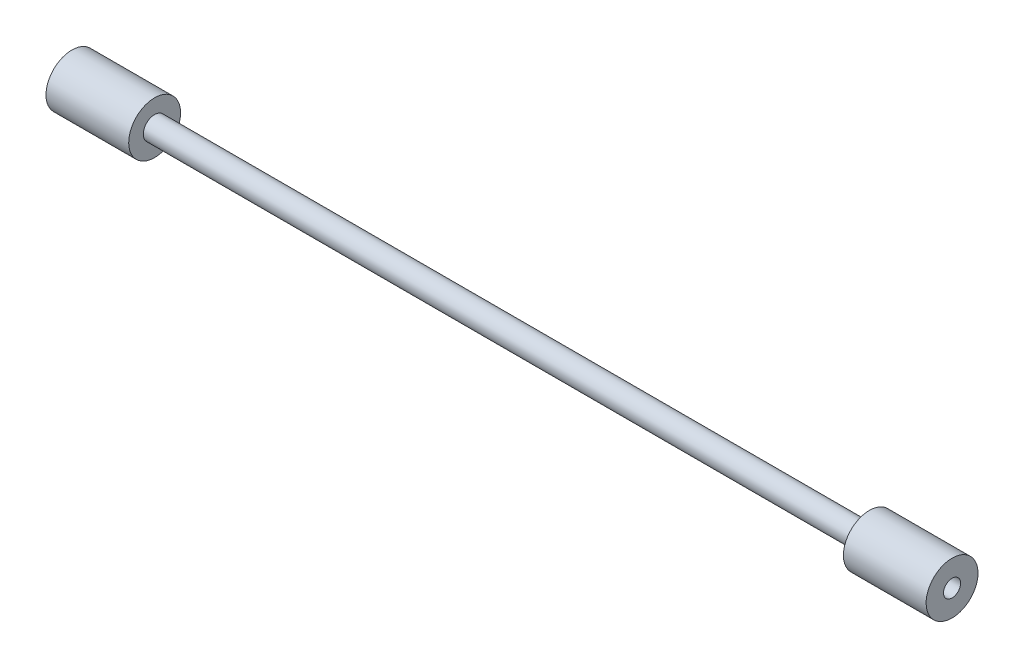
from build123d import *


with BuildPart() as part:
    # Sketch1 → Revolve1 (revolve)
    with BuildSketch(Plane.XY):
        Polygon((27.78125, 0), (436.78125, 0), (436.78125, 4.5), (464.5625, 4.5), (464.5625, 13.6921875), (420.90625, 13.6921875), (420.90625, 6), (43.65625, 6), (43.65625, 13.6921875), (0, 13.6921875), (0, 4.5), (27.78125, 4.5), align=None)
    revolve(axis=Axis((0, 0, 0), (-1, 0, 0)))


solid = part.part
